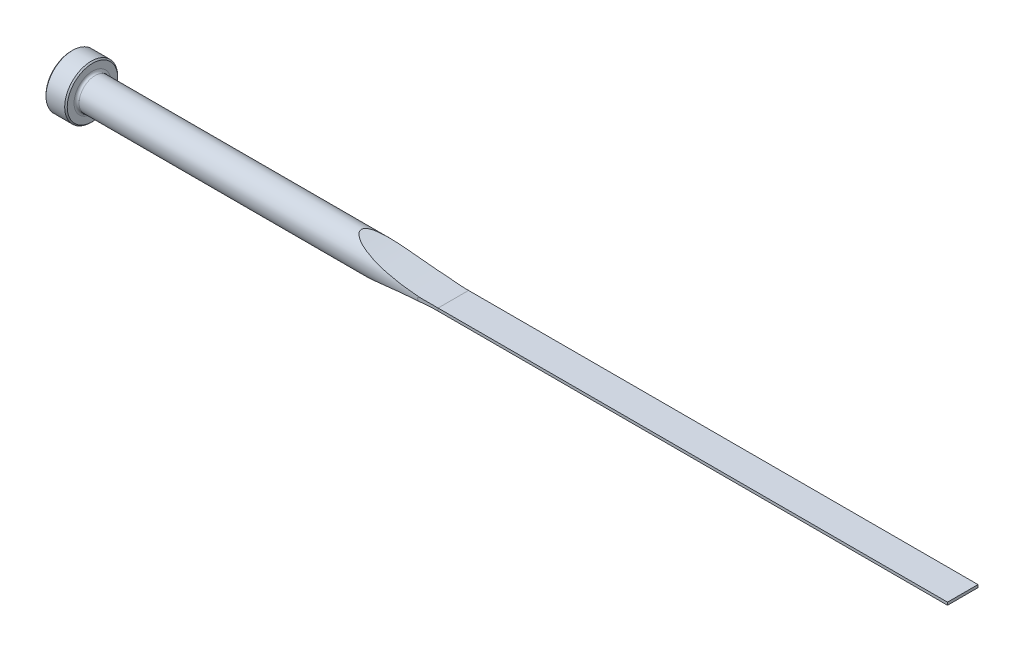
from build123d import *

# Parameters (mm, degrees)
CUT_EXTRUDE1_DEPTH = 267.936130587
CUT_EXTRUDE2_DEPTH = 267.936130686
FILLET1_R          = 0.762
CHAMFER1_SIZE      = 0.381


with BuildPart() as part:
    # Sketch1 → Revolve1 (revolve)
    with BuildSketch(Plane.XY, mode=Mode.PRIVATE) as revolve1_sk:
        Polygon((0, 0), (0, 7.9375), (6.35, 7.9375), (6.35, 4.7625), (266.7, 4.7625), (266.7, 0), align=None)
    revolve(revolve1_sk.sketch.rotate(Axis((0, 0, 0), (1, 0, 0)), 90), axis=Axis((0, 0, 0), (1, 0, 0)))

    # Sketch2 → Cut-Extrude1 (cut, symmetric)
    with BuildSketch(Plane.XY):
        with BuildLine():
            Line((266.7, 4.7625), (266.7, 0.4064))
            Line((266.7, 0.4064), (114.3, 0.4064))
            ThreePointArc((114.3, 0.4064), (100.384948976, 1.502178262), (86.812930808, 4.7625))
            Line((86.812930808, 4.7625), (266.7, 4.7625))
        make_face()
    cut_extrude1 = extrude(amount=CUT_EXTRUDE1_DEPTH, both=True, mode=Mode.SUBTRACT)

    # Mirror1: Cut-Extrude1 across plane
    add(cut_extrude1.mirror(Plane.ZX), mode=Mode.SUBTRACT)

    # Sketch3 → Cut-Extrude2 (cut, symmetric)
    with BuildSketch(Plane(origin=(0, 0, 0), x_dir=(1, 0, 0), z_dir=(0, 1, 0))):
        with BuildLine():
            Line((266.7, 4.7625), (266.7, 4.5593))
            Line((266.7, 4.5593), (114.3, 4.5593))
            ThreePointArc((114.3, 4.5593), (111.29463147, 4.610114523), (108.292698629, 4.7625))
            Line((108.292698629, 4.7625), (266.7, 4.7625))
        make_face()
    cut_extrude2 = extrude(amount=CUT_EXTRUDE2_DEPTH, both=True, mode=Mode.SUBTRACT)

    # Mirror2: Cut-Extrude2 across plane
    add(cut_extrude2.mirror(Plane.XY), mode=Mode.SUBTRACT)

    # Fillet1
    fillet1_edges = [part.edges().sort_by_distance(p)[0] for p in [
        (6.35, 0, -4.7625),
    ]]
    fillet(fillet1_edges, radius=FILLET1_R)

    # Chamfer1
    chamfer1_edges = [part.edges().sort_by_distance(p)[0] for p in [
        (6.35, 0, -7.9375),
        (0, 0, -7.9375),
    ]]
    chamfer(chamfer1_edges, length=CHAMFER1_SIZE)


solid = part.part
